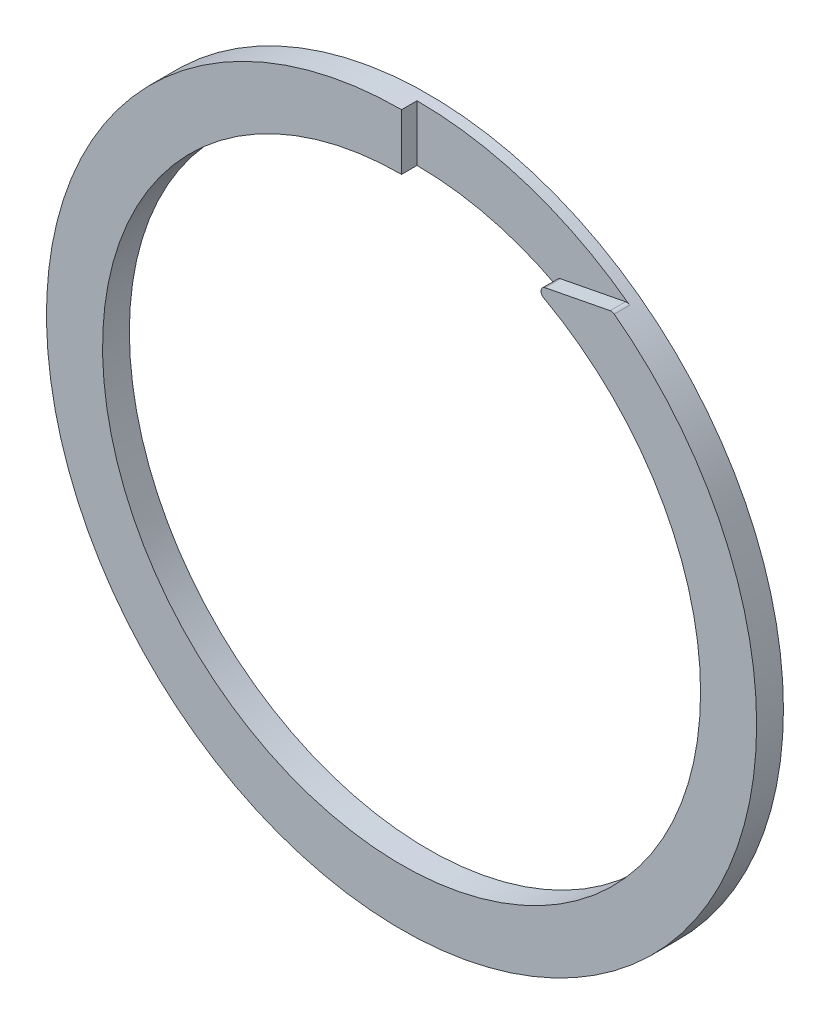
ISO-10303-21;
HEADER;
FILE_DESCRIPTION(('STEP AP214'),'2;1');
FILE_NAME('part.step','',(''),(''),'','','');
FILE_SCHEMA(('AUTOMOTIVE_DESIGN { 1 0 10303 214 1 1 1 1 }'));
ENDSEC;
DATA;
#1=APPLICATION_CONTEXT('core data for automotive mechanical design processes');
#2=APPLICATION_PROTOCOL_DEFINITION('international standard','automotive_design',2000,#1);
#3=PRODUCT_CONTEXT('',#1,'mechanical');
#4=PRODUCT('Part','Part','',(#3));
#5=PRODUCT_RELATED_PRODUCT_CATEGORY('part','',(#4));
#6=PRODUCT_DEFINITION_FORMATION('','',#4);
#7=PRODUCT_DEFINITION_CONTEXT('part definition',#1,'design');
#8=PRODUCT_DEFINITION('design','',#6,#7);
#9=PRODUCT_DEFINITION_SHAPE('','',#8);
#10=(LENGTH_UNIT() NAMED_UNIT(*) SI_UNIT(.MILLI.,.METRE.));
#11=(NAMED_UNIT(*) PLANE_ANGLE_UNIT() SI_UNIT($,.RADIAN.));
#12=(NAMED_UNIT(*) SI_UNIT($,.STERADIAN.) SOLID_ANGLE_UNIT());
#13=UNCERTAINTY_MEASURE_WITH_UNIT(LENGTH_MEASURE(1.E-05),#10,'distance_accuracy_value','');
#14=(GEOMETRIC_REPRESENTATION_CONTEXT(3) GLOBAL_UNCERTAINTY_ASSIGNED_CONTEXT((#13)) GLOBAL_UNIT_ASSIGNED_CONTEXT((#10,
#11,#12)) REPRESENTATION_CONTEXT('',''));
#15=CARTESIAN_POINT('',(0.,0.,0.));
#16=DIRECTION('',(0.,0.,1.));
#17=DIRECTION('',(1.,0.,0.));
#18=AXIS2_PLACEMENT_3D('',#15,#16,#17);
#19=CARTESIAN_POINT('',(0.,13.775,1.04));
#20=DIRECTION('',(-1.,0.,0.));
#21=DIRECTION('',(0.,0.,1.));
#22=AXIS2_PLACEMENT_3D('',#19,#20,#21);
#23=PLANE('',#22);
#24=DIRECTION('',(0.,1.,0.));
#25=VECTOR('',#24,1.);
#26=CARTESIAN_POINT('',(0.,0.,1.04));
#27=LINE('',#26,#25);
#28=CARTESIAN_POINT('',(0.,13.775,1.04));
#29=VERTEX_POINT('',#28);
#30=CARTESIAN_POINT('',(0.,11.6,1.04));
#31=VERTEX_POINT('',#30);
#32=EDGE_CURVE('E107',#29,#31,#27,.F.);
#33=ORIENTED_EDGE('',*,*,#32,.T.);
#34=DIRECTION('',(0.,0.,1.));
#35=VECTOR('',#34,1.);
#36=CARTESIAN_POINT('',(0.,11.6,1.04));
#37=LINE('',#36,#35);
#38=CARTESIAN_POINT('',(0.,11.6,0.44));
#39=VERTEX_POINT('',#38);
#40=EDGE_CURVE('E93',#39,#31,#37,.T.);
#41=ORIENTED_EDGE('',*,*,#40,.F.);
#42=DIRECTION('',(0.,-1.,0.));
#43=VECTOR('',#42,1.);
#44=CARTESIAN_POINT('',(0.,12.0312518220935,0.44));
#45=LINE('',#44,#43);
#46=CARTESIAN_POINT('',(0.,13.775,0.44));
#47=VERTEX_POINT('',#46);
#48=EDGE_CURVE('E77',#47,#39,#45,.T.);
#49=ORIENTED_EDGE('',*,*,#48,.F.);
#50=DIRECTION('',(0.,0.,1.));
#51=VECTOR('',#50,1.);
#52=CARTESIAN_POINT('',(0.,13.775,1.04));
#53=LINE('',#52,#51);
#54=EDGE_CURVE('E90',#29,#47,#53,.F.);
#55=ORIENTED_EDGE('',*,*,#54,.F.);
#56=EDGE_LOOP('',(#33,#41,#49,#55));
#57=FACE_BOUND('',#56,.T.);
#58=ADVANCED_FACE('F17',(#57),#23,.F.);
#59=CARTESIAN_POINT('',(5.,10.4670912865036,1.04));
#60=DIRECTION('',(0.190808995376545,-0.981627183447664,0.));
#61=DIRECTION('',(0.981627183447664,0.190808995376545,0.));
#62=AXIS2_PLACEMENT_3D('',#59,#60,#61);
#63=PLANE('',#62);
#64=DIRECTION('',(0.,0.,1.));
#65=VECTOR('',#64,1.);
#66=CARTESIAN_POINT('',(5.57076566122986,10.5780368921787,1.04));
#67=LINE('',#66,#65);
#68=CARTESIAN_POINT('',(5.57076566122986,10.5780368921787,1.04));
#69=VERTEX_POINT('',#68);
#70=CARTESIAN_POINT('',(5.57076566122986,10.5780368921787,0.44));
#71=VERTEX_POINT('',#70);
#72=EDGE_CURVE('E67',#69,#71,#67,.F.);
#73=ORIENTED_EDGE('',*,*,#72,.F.);
#74=DIRECTION('',(0.981627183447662,0.190808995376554,0.));
#75=VECTOR('',#74,1.);
#76=CARTESIAN_POINT('',(5.57076566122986,10.5780368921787,1.04));
#77=LINE('',#76,#75);
#78=CARTESIAN_POINT('',(8.0912815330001,11.0679755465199,1.04));
#79=VERTEX_POINT('',#78);
#80=EDGE_CURVE('E64',#69,#79,#77,.T.);
#81=ORIENTED_EDGE('',*,*,#80,.T.);
#82=DIRECTION('',(0.,0.,1.));
#83=VECTOR('',#82,1.);
#84=CARTESIAN_POINT('',(8.0912815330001,11.0679755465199,0.));
#85=LINE('',#84,#83);
#86=CARTESIAN_POINT('',(8.0912815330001,11.0679755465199,0.44));
#87=VERTEX_POINT('',#86);
#88=EDGE_CURVE('E58',#87,#79,#85,.T.);
#89=ORIENTED_EDGE('',*,*,#88,.F.);
#90=DIRECTION('',(0.981627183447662,0.190808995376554,0.));
#91=VECTOR('',#90,1.);
#92=CARTESIAN_POINT('',(5.57076566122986,10.5780368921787,0.44));
#93=LINE('',#92,#91);
#94=EDGE_CURVE('E63',#71,#87,#93,.T.);
#95=ORIENTED_EDGE('',*,*,#94,.F.);
#96=EDGE_LOOP('',(#73,#81,#89,#95));
#97=FACE_BOUND('',#96,.T.);
#98=ADVANCED_FACE('F61',(#97),#63,.F.);
#99=CARTESIAN_POINT('',(8.12944333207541,10.8716501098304,0.));
#100=DIRECTION('',(0.,0.,1.));
#101=DIRECTION('',(1.,0.,0.));
#102=AXIS2_PLACEMENT_3D('',#99,#100,#101);
#103=CYLINDRICAL_SURFACE('',#102,0.200000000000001);
#104=CARTESIAN_POINT('',(8.12944333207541,10.8716501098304,1.04));
#105=DIRECTION('',(0.,0.,1.));
#106=DIRECTION('',(1.,0.,0.));
#107=AXIS2_PLACEMENT_3D('',#104,#105,#106);
#108=CIRCLE('',#107,0.200000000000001);
#109=CARTESIAN_POINT('',(8.24921413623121,11.0318217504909,1.04));
#110=VERTEX_POINT('',#109);
#111=EDGE_CURVE('E108',#79,#110,#108,.F.);
#112=ORIENTED_EDGE('',*,*,#111,.T.);
#113=DIRECTION('',(0.,0.,1.));
#114=VECTOR('',#113,1.);
#115=CARTESIAN_POINT('',(8.2492141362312,11.0318217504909,0.));
#116=LINE('',#115,#114);
#117=CARTESIAN_POINT('',(8.24921413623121,11.0318217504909,0.44));
#118=VERTEX_POINT('',#117);
#119=EDGE_CURVE('E73',#118,#110,#116,.T.);
#120=ORIENTED_EDGE('',*,*,#119,.F.);
#121=CARTESIAN_POINT('',(8.12944333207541,10.8716501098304,0.44));
#122=DIRECTION('',(0.,0.,1.));
#123=DIRECTION('',(1.,0.,0.));
#124=AXIS2_PLACEMENT_3D('',#121,#122,#123);
#125=CIRCLE('',#124,0.200000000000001);
#126=EDGE_CURVE('E20',#87,#118,#125,.F.);
#127=ORIENTED_EDGE('',*,*,#126,.F.);
#128=ORIENTED_EDGE('',*,*,#88,.T.);
#129=EDGE_LOOP('',(#112,#120,#127,#128));
#130=FACE_BOUND('',#129,.T.);
#131=ADVANCED_FACE('F71',(#130),#103,.T.);
#132=CARTESIAN_POINT('',(3.6914211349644,12.0312518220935,0.44));
#133=DIRECTION('',(0.,0.,1.));
#134=DIRECTION('',(0.,-1.,0.));
#135=AXIS2_PLACEMENT_3D('',#132,#133,#134);
#136=PLANE('',#135);
#137=CARTESIAN_POINT('',(5.60892746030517,10.3817114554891,0.44));
#138=DIRECTION('',(0.,0.,-1.));
#139=DIRECTION('',(-1.,0.,0.));
#140=AXIS2_PLACEMENT_3D('',#137,#138,#139);
#141=CIRCLE('',#140,0.2);
#142=CARTESIAN_POINT('',(5.51386089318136,10.2057502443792,0.44));
#143=VERTEX_POINT('',#142);
#144=EDGE_CURVE('E80',#71,#143,#141,.F.);
#145=ORIENTED_EDGE('',*,*,#144,.F.);
#146=ORIENTED_EDGE('',*,*,#94,.T.);
#147=ORIENTED_EDGE('',*,*,#126,.T.);
#148=CARTESIAN_POINT('',(0.,0.,0.44));
#149=DIRECTION('',(0.,0.,1.));
#150=DIRECTION('',(1.,0.,0.));
#151=AXIS2_PLACEMENT_3D('',#148,#149,#150);
#152=CIRCLE('',#151,13.775);
#153=EDGE_CURVE('E88',#47,#118,#152,.F.);
#154=ORIENTED_EDGE('',*,*,#153,.F.);
#155=ORIENTED_EDGE('',*,*,#48,.T.);
#156=CARTESIAN_POINT('',(0.,0.,0.44));
#157=DIRECTION('',(0.,0.,1.));
#158=DIRECTION('',(1.,0.,0.));
#159=AXIS2_PLACEMENT_3D('',#156,#157,#158);
#160=CIRCLE('',#159,11.6);
#161=EDGE_CURVE('E101',#39,#143,#160,.F.);
#162=ORIENTED_EDGE('',*,*,#161,.T.);
#163=EDGE_LOOP('',(#145,#146,#147,#154,#155,#162));
#164=FACE_BOUND('',#163,.T.);
#165=ADVANCED_FACE('F78',(#164),#136,.T.);
#166=CARTESIAN_POINT('',(5.60892746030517,10.3817114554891,0.));
#167=DIRECTION('',(0.,0.,-1.));
#168=DIRECTION('',(-1.,0.,0.));
#169=AXIS2_PLACEMENT_3D('',#166,#167,#168);
#170=CYLINDRICAL_SURFACE('',#169,0.2);
#171=ORIENTED_EDGE('',*,*,#144,.T.);
#172=DIRECTION('',(0.,0.,1.));
#173=VECTOR('',#172,1.);
#174=CARTESIAN_POINT('',(5.51386089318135,10.2057502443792,0.));
#175=LINE('',#174,#173);
#176=CARTESIAN_POINT('',(5.51386089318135,10.2057502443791,1.04));
#177=VERTEX_POINT('',#176);
#178=EDGE_CURVE('E100',#143,#177,#175,.T.);
#179=ORIENTED_EDGE('',*,*,#178,.T.);
#180=CARTESIAN_POINT('',(5.60892746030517,10.3817114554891,1.04));
#181=DIRECTION('',(0.,0.,-1.));
#182=DIRECTION('',(-1.,0.,0.));
#183=AXIS2_PLACEMENT_3D('',#180,#181,#182);
#184=CIRCLE('',#183,0.2);
#185=EDGE_CURVE('E35',#177,#69,#184,.T.);
#186=ORIENTED_EDGE('',*,*,#185,.T.);
#187=ORIENTED_EDGE('',*,*,#72,.T.);
#188=EDGE_LOOP('',(#171,#179,#186,#187));
#189=FACE_BOUND('',#188,.T.);
#190=ADVANCED_FACE('F133',(#189),#170,.T.);
#191=CARTESIAN_POINT('',(0.,0.,1.04));
#192=DIRECTION('',(0.,0.,-1.));
#193=DIRECTION('',(-1.,0.,0.));
#194=AXIS2_PLACEMENT_3D('',#191,#192,#193);
#195=PLANE('',#194);
#196=ORIENTED_EDGE('',*,*,#185,.F.);
#197=CARTESIAN_POINT('',(0.,0.,1.04));
#198=DIRECTION('',(0.,0.,1.));
#199=DIRECTION('',(1.,0.,0.));
#200=AXIS2_PLACEMENT_3D('',#197,#198,#199);
#201=CIRCLE('',#200,11.6);
#202=EDGE_CURVE('E98',#177,#31,#201,.F.);
#203=ORIENTED_EDGE('',*,*,#202,.T.);
#204=ORIENTED_EDGE('',*,*,#32,.F.);
#205=CARTESIAN_POINT('',(0.,0.,1.04));
#206=DIRECTION('',(0.,0.,1.));
#207=DIRECTION('',(1.,0.,0.));
#208=AXIS2_PLACEMENT_3D('',#205,#206,#207);
#209=CIRCLE('',#208,13.775);
#210=EDGE_CURVE('E87',#110,#29,#209,.F.);
#211=ORIENTED_EDGE('',*,*,#210,.F.);
#212=ORIENTED_EDGE('',*,*,#111,.F.);
#213=ORIENTED_EDGE('',*,*,#80,.F.);
#214=EDGE_LOOP('',(#196,#203,#204,#211,#212,#213));
#215=FACE_BOUND('',#214,.T.);
#216=ADVANCED_FACE('F130',(#215),#195,.F.);
#217=CARTESIAN_POINT('',(0.,0.,0.));
#218=DIRECTION('',(0.,0.,1.));
#219=DIRECTION('',(1.,0.,0.));
#220=AXIS2_PLACEMENT_3D('',#217,#218,#219);
#221=CYLINDRICAL_SURFACE('',#220,13.775);
#222=ORIENTED_EDGE('',*,*,#210,.T.);
#223=ORIENTED_EDGE('',*,*,#54,.T.);
#224=ORIENTED_EDGE('',*,*,#153,.T.);
#225=ORIENTED_EDGE('',*,*,#119,.T.);
#226=EDGE_LOOP('',(#222,#223,#224,#225));
#227=FACE_BOUND('',#226,.T.);
#228=CARTESIAN_POINT('',(0.,0.,0.));
#229=DIRECTION('',(0.,0.,1.));
#230=DIRECTION('',(1.,0.,0.));
#231=AXIS2_PLACEMENT_3D('',#228,#229,#230);
#232=CIRCLE('',#231,13.775);
#233=CARTESIAN_POINT('',(13.775,0.,0.));
#234=VERTEX_POINT('',#233);
#235=EDGE_CURVE('E26',#234,#234,#232,.F.);
#236=ORIENTED_EDGE('',*,*,#235,.F.);
#237=EDGE_LOOP('',(#236));
#238=FACE_BOUND('',#237,.T.);
#239=ADVANCED_FACE('F141',(#227,#238),#221,.T.);
#240=CARTESIAN_POINT('',(0.,0.,0.));
#241=DIRECTION('',(0.,0.,1.));
#242=DIRECTION('',(1.,0.,0.));
#243=AXIS2_PLACEMENT_3D('',#240,#241,#242);
#244=CYLINDRICAL_SURFACE('',#243,11.6);
#245=ORIENTED_EDGE('',*,*,#202,.F.);
#246=ORIENTED_EDGE('',*,*,#178,.F.);
#247=ORIENTED_EDGE('',*,*,#161,.F.);
#248=ORIENTED_EDGE('',*,*,#40,.T.);
#249=EDGE_LOOP('',(#245,#246,#247,#248));
#250=FACE_BOUND('',#249,.T.);
#251=CARTESIAN_POINT('',(0.,0.,0.));
#252=DIRECTION('',(0.,0.,1.));
#253=DIRECTION('',(1.,0.,0.));
#254=AXIS2_PLACEMENT_3D('',#251,#252,#253);
#255=CIRCLE('',#254,11.6);
#256=CARTESIAN_POINT('',(11.6,0.,0.));
#257=VERTEX_POINT('',#256);
#258=EDGE_CURVE('E11',#257,#257,#255,.T.);
#259=ORIENTED_EDGE('',*,*,#258,.F.);
#260=EDGE_LOOP('',(#259));
#261=FACE_BOUND('',#260,.T.);
#262=ADVANCED_FACE('F121',(#250,#261),#244,.F.);
#263=CARTESIAN_POINT('',(0.,0.,0.));
#264=DIRECTION('',(0.,0.,-1.));
#265=DIRECTION('',(-1.,0.,0.));
#266=AXIS2_PLACEMENT_3D('',#263,#264,#265);
#267=PLANE('',#266);
#268=ORIENTED_EDGE('',*,*,#258,.T.);
#269=EDGE_LOOP('',(#268));
#270=FACE_BOUND('',#269,.T.);
#271=ORIENTED_EDGE('',*,*,#235,.T.);
#272=EDGE_LOOP('',(#271));
#273=FACE_BOUND('',#272,.T.);
#274=ADVANCED_FACE('F144',(#270,#273),#267,.T.);
#275=CLOSED_SHELL('',(#58,#98,#131,#165,#190,#216,#239,#262,#274));
#276=MANIFOLD_SOLID_BREP('B1',#275);
#277=ADVANCED_BREP_SHAPE_REPRESENTATION('',(#18,#276),#14);
#278=SHAPE_DEFINITION_REPRESENTATION(#9,#277);
ENDSEC;
END-ISO-10303-21;
